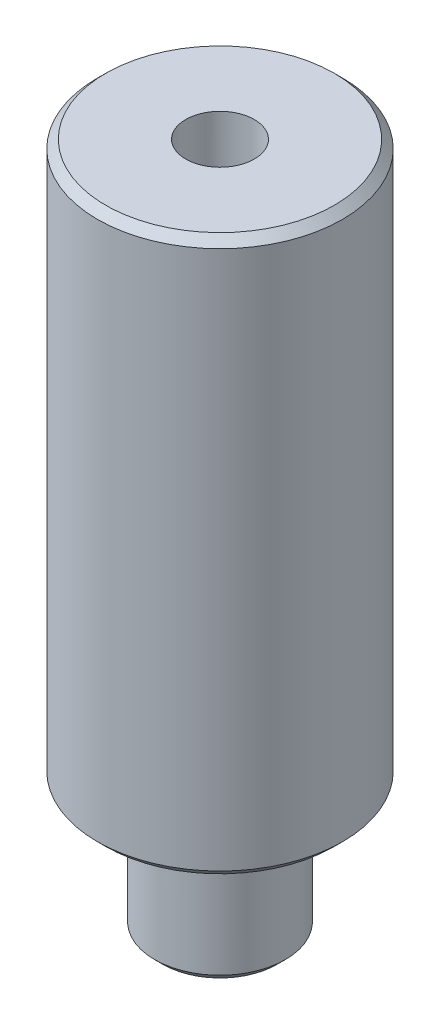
ISO-10303-21;
HEADER;
FILE_DESCRIPTION(('STEP AP214'),'2;1');
FILE_NAME('part.step','',(''),(''),'','','');
FILE_SCHEMA(('AUTOMOTIVE_DESIGN { 1 0 10303 214 1 1 1 1 }'));
ENDSEC;
DATA;
#1=APPLICATION_CONTEXT('core data for automotive mechanical design processes');
#2=APPLICATION_PROTOCOL_DEFINITION('international standard','automotive_design',2000,#1);
#3=PRODUCT_CONTEXT('',#1,'mechanical');
#4=PRODUCT('Part','Part','',(#3));
#5=PRODUCT_RELATED_PRODUCT_CATEGORY('part','',(#4));
#6=PRODUCT_DEFINITION_FORMATION('','',#4);
#7=PRODUCT_DEFINITION_CONTEXT('part definition',#1,'design');
#8=PRODUCT_DEFINITION('design','',#6,#7);
#9=PRODUCT_DEFINITION_SHAPE('','',#8);
#10=(LENGTH_UNIT() NAMED_UNIT(*) SI_UNIT(.MILLI.,.METRE.));
#11=(NAMED_UNIT(*) PLANE_ANGLE_UNIT() SI_UNIT($,.RADIAN.));
#12=(NAMED_UNIT(*) SI_UNIT($,.STERADIAN.) SOLID_ANGLE_UNIT());
#13=UNCERTAINTY_MEASURE_WITH_UNIT(LENGTH_MEASURE(1.E-05),#10,'distance_accuracy_value','');
#14=(GEOMETRIC_REPRESENTATION_CONTEXT(3) GLOBAL_UNCERTAINTY_ASSIGNED_CONTEXT((#13)) GLOBAL_UNIT_ASSIGNED_CONTEXT((#10,
#11,#12)) REPRESENTATION_CONTEXT('',''));
#15=CARTESIAN_POINT('',(0.,0.,0.));
#16=DIRECTION('',(0.,0.,1.));
#17=DIRECTION('',(1.,0.,0.));
#18=AXIS2_PLACEMENT_3D('',#15,#16,#17);
#19=CARTESIAN_POINT('',(0.,-8.00000000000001,0.));
#20=DIRECTION('',(0.,-1.,0.));
#21=DIRECTION('',(1.,0.,0.));
#22=AXIS2_PLACEMENT_3D('',#19,#20,#21);
#23=PLANE('',#22);
#24=CARTESIAN_POINT('',(0.,-8.0000000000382,0.));
#25=DIRECTION('',(0.,1.,0.));
#26=DIRECTION('',(0.,0.,1.));
#27=AXIS2_PLACEMENT_3D('',#24,#25,#26);
#28=CIRCLE('',#27,3.49999999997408);
#29=CARTESIAN_POINT('',(0.,-8.0000000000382,3.49999999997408));
#30=VERTEX_POINT('',#29);
#31=EDGE_CURVE('E19',#30,#30,#28,.T.);
#32=ORIENTED_EDGE('',*,*,#31,.F.);
#33=EDGE_LOOP('',(#32));
#34=FACE_BOUND('',#33,.T.);
#35=ADVANCED_FACE('F16',(#34),#23,.T.);
#36=CARTESIAN_POINT('',(0.,-7.49999999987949,0.));
#37=DIRECTION('',(0.,1.,0.));
#38=DIRECTION('',(0.,0.,1.));
#39=AXIS2_PLACEMENT_3D('',#36,#37,#38);
#40=CONICAL_SURFACE('',#39,4.00000000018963,0.785398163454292);
#41=CARTESIAN_POINT('',(0.,-7.50000000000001,0.));
#42=DIRECTION('',(0.,-1.,0.));
#43=DIRECTION('',(1.,0.,0.));
#44=AXIS2_PLACEMENT_3D('',#41,#42,#43);
#45=CIRCLE('',#44,4.);
#46=CARTESIAN_POINT('',(4.,-7.50000000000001,0.));
#47=VERTEX_POINT('',#46);
#48=EDGE_CURVE('E38',#47,#47,#45,.F.);
#49=ORIENTED_EDGE('',*,*,#48,.F.);
#50=EDGE_LOOP('',(#49));
#51=FACE_BOUND('',#50,.T.);
#52=ORIENTED_EDGE('',*,*,#31,.T.);
#53=EDGE_LOOP('',(#52));
#54=FACE_BOUND('',#53,.T.);
#55=ADVANCED_FACE('F31',(#51,#54),#40,.T.);
#56=CARTESIAN_POINT('',(0.,23.9999999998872,0.));
#57=DIRECTION('',(0.,1.,0.));
#58=DIRECTION('',(0.,0.,1.));
#59=AXIS2_PLACEMENT_3D('',#56,#57,#58);
#60=CONICAL_SURFACE('',#59,2.09999999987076,1.02974425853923);
#61=CARTESIAN_POINT('',(0.,22.7381926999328,0.));
#62=VERTEX_POINT('',#61);
#63=VERTEX_LOOP('',#62);
#64=FACE_BOUND('',#63,.T.);
#65=CARTESIAN_POINT('',(0.,24.,0.));
#66=DIRECTION('',(0.,1.,0.));
#67=DIRECTION('',(-1.,0.,0.));
#68=AXIS2_PLACEMENT_3D('',#65,#66,#67);
#69=CIRCLE('',#68,2.1);
#70=CARTESIAN_POINT('',(-2.1,24.,0.));
#71=VERTEX_POINT('',#70);
#72=EDGE_CURVE('E35',#71,#71,#69,.T.);
#73=ORIENTED_EDGE('',*,*,#72,.T.);
#74=EDGE_LOOP('',(#73));
#75=FACE_BOUND('',#74,.T.);
#76=ADVANCED_FACE('F27',(#64,#75),#60,.F.);
#77=CARTESIAN_POINT('',(0.,0.,0.));
#78=DIRECTION('',(0.,-1.,0.));
#79=DIRECTION('',(1.,0.,0.));
#80=AXIS2_PLACEMENT_3D('',#77,#78,#79);
#81=CYLINDRICAL_SURFACE('',#80,4.);
#82=ORIENTED_EDGE('',*,*,#48,.T.);
#83=EDGE_LOOP('',(#82));
#84=FACE_BOUND('',#83,.T.);
#85=CARTESIAN_POINT('',(0.,0.,0.));
#86=DIRECTION('',(0.,-1.,0.));
#87=DIRECTION('',(1.,0.,0.));
#88=AXIS2_PLACEMENT_3D('',#85,#86,#87);
#89=CIRCLE('',#88,4.);
#90=CARTESIAN_POINT('',(4.,0.,0.));
#91=VERTEX_POINT('',#90);
#92=EDGE_CURVE('E37',#91,#91,#89,.T.);
#93=ORIENTED_EDGE('',*,*,#92,.T.);
#94=EDGE_LOOP('',(#93));
#95=FACE_BOUND('',#94,.T.);
#96=ADVANCED_FACE('F30',(#84,#95),#81,.T.);
#97=CARTESIAN_POINT('',(0.,22.17510233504,0.));
#98=DIRECTION('',(0.,1.,0.));
#99=DIRECTION('',(-1.,0.,0.));
#100=AXIS2_PLACEMENT_3D('',#97,#98,#99);
#101=CYLINDRICAL_SURFACE('',#100,2.1);
#102=ORIENTED_EDGE('',*,*,#72,.F.);
#103=EDGE_LOOP('',(#102));
#104=FACE_BOUND('',#103,.T.);
#105=CARTESIAN_POINT('',(0.,34.,0.));
#106=DIRECTION('',(0.,1.,0.));
#107=DIRECTION('',(-1.,0.,0.));
#108=AXIS2_PLACEMENT_3D('',#105,#106,#107);
#109=CIRCLE('',#108,2.1);
#110=CARTESIAN_POINT('',(-2.1,34.,0.));
#111=VERTEX_POINT('',#110);
#112=EDGE_CURVE('E41',#111,#111,#109,.F.);
#113=ORIENTED_EDGE('',*,*,#112,.F.);
#114=EDGE_LOOP('',(#113));
#115=FACE_BOUND('',#114,.T.);
#116=ADVANCED_FACE('F57',(#104,#115),#101,.F.);
#117=CARTESIAN_POINT('',(0.,0.,0.));
#118=DIRECTION('',(0.,1.,0.));
#119=DIRECTION('',(-1.,0.,0.));
#120=AXIS2_PLACEMENT_3D('',#117,#118,#119);
#121=PLANE('',#120);
#122=CARTESIAN_POINT('',(0.,0.,0.));
#123=DIRECTION('',(0.,1.,0.));
#124=DIRECTION('',(0.,0.,1.));
#125=AXIS2_PLACEMENT_3D('',#122,#123,#124);
#126=CIRCLE('',#125,7.00000000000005);
#127=CARTESIAN_POINT('',(0.,0.,7.00000000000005));
#128=VERTEX_POINT('',#127);
#129=EDGE_CURVE('E49',#128,#128,#126,.T.);
#130=ORIENTED_EDGE('',*,*,#129,.F.);
#131=EDGE_LOOP('',(#130));
#132=FACE_BOUND('',#131,.T.);
#133=ORIENTED_EDGE('',*,*,#92,.F.);
#134=EDGE_LOOP('',(#133));
#135=FACE_BOUND('',#134,.T.);
#136=ADVANCED_FACE('F59',(#132,#135),#121,.F.);
#137=CARTESIAN_POINT('',(0.,34.,0.));
#138=DIRECTION('',(0.,1.,0.));
#139=DIRECTION('',(-1.,0.,0.));
#140=AXIS2_PLACEMENT_3D('',#137,#138,#139);
#141=PLANE('',#140);
#142=CARTESIAN_POINT('',(0.,34.,0.));
#143=DIRECTION('',(0.,-1.,0.));
#144=DIRECTION('',(0.,0.,-1.));
#145=AXIS2_PLACEMENT_3D('',#142,#143,#144);
#146=CIRCLE('',#145,7.00000000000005);
#147=CARTESIAN_POINT('',(0.,34.,-7.00000000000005));
#148=VERTEX_POINT('',#147);
#149=EDGE_CURVE('E46',#148,#148,#146,.T.);
#150=ORIENTED_EDGE('',*,*,#149,.F.);
#151=EDGE_LOOP('',(#150));
#152=FACE_BOUND('',#151,.T.);
#153=ORIENTED_EDGE('',*,*,#112,.T.);
#154=EDGE_LOOP('',(#153));
#155=FACE_BOUND('',#154,.T.);
#156=ADVANCED_FACE('F55',(#152,#155),#141,.T.);
#157=CARTESIAN_POINT('',(0.,0.500000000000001,0.));
#158=DIRECTION('',(0.,1.,0.));
#159=DIRECTION('',(0.,0.,1.));
#160=AXIS2_PLACEMENT_3D('',#157,#158,#159);
#161=CONICAL_SURFACE('',#160,7.49999999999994,0.7853981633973);
#162=CARTESIAN_POINT('',(0.,0.5,0.));
#163=DIRECTION('',(0.,1.,0.));
#164=DIRECTION('',(-1.,0.,0.));
#165=AXIS2_PLACEMENT_3D('',#162,#163,#164);
#166=CIRCLE('',#165,7.5);
#167=CARTESIAN_POINT('',(-7.5,0.5,0.));
#168=VERTEX_POINT('',#167);
#169=EDGE_CURVE('E23',#168,#168,#166,.T.);
#170=ORIENTED_EDGE('',*,*,#169,.F.);
#171=EDGE_LOOP('',(#170));
#172=FACE_BOUND('',#171,.T.);
#173=ORIENTED_EDGE('',*,*,#129,.T.);
#174=EDGE_LOOP('',(#173));
#175=FACE_BOUND('',#174,.T.);
#176=ADVANCED_FACE('F78',(#172,#175),#161,.T.);
#177=CARTESIAN_POINT('',(0.,33.5,0.));
#178=DIRECTION('',(0.,-1.,0.));
#179=DIRECTION('',(0.,0.,-1.));
#180=AXIS2_PLACEMENT_3D('',#177,#178,#179);
#181=CONICAL_SURFACE('',#180,7.49999999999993,0.7853981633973);
#182=CARTESIAN_POINT('',(0.,33.5,0.));
#183=DIRECTION('',(0.,1.,0.));
#184=DIRECTION('',(-1.,0.,0.));
#185=AXIS2_PLACEMENT_3D('',#182,#183,#184);
#186=CIRCLE('',#185,7.5);
#187=CARTESIAN_POINT('',(-7.5,33.5,0.));
#188=VERTEX_POINT('',#187);
#189=EDGE_CURVE('E11',#188,#188,#186,.F.);
#190=ORIENTED_EDGE('',*,*,#189,.F.);
#191=EDGE_LOOP('',(#190));
#192=FACE_BOUND('',#191,.T.);
#193=ORIENTED_EDGE('',*,*,#149,.T.);
#194=EDGE_LOOP('',(#193));
#195=FACE_BOUND('',#194,.T.);
#196=ADVANCED_FACE('F72',(#192,#195),#181,.T.);
#197=CARTESIAN_POINT('',(0.,0.,0.));
#198=DIRECTION('',(0.,1.,0.));
#199=DIRECTION('',(-1.,0.,0.));
#200=AXIS2_PLACEMENT_3D('',#197,#198,#199);
#201=CYLINDRICAL_SURFACE('',#200,7.5);
#202=ORIENTED_EDGE('',*,*,#189,.T.);
#203=EDGE_LOOP('',(#202));
#204=FACE_BOUND('',#203,.T.);
#205=ORIENTED_EDGE('',*,*,#169,.T.);
#206=EDGE_LOOP('',(#205));
#207=FACE_BOUND('',#206,.T.);
#208=ADVANCED_FACE('F70',(#204,#207),#201,.T.);
#209=CLOSED_SHELL('',(#35,#55,#76,#96,#116,#136,#156,#176,#196,#208));
#210=MANIFOLD_SOLID_BREP('B1',#209);
#211=ADVANCED_BREP_SHAPE_REPRESENTATION('',(#18,#210),#14);
#212=SHAPE_DEFINITION_REPRESENTATION(#9,#211);
ENDSEC;
END-ISO-10303-21;
